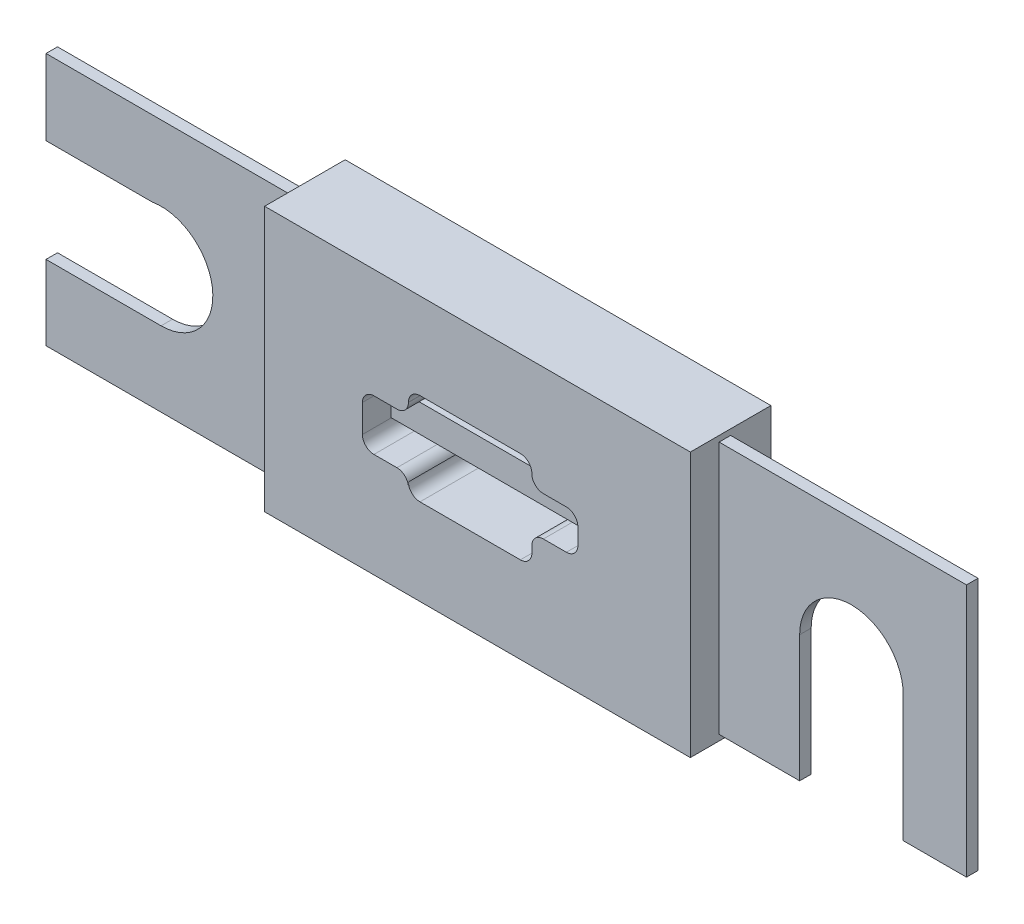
from build123d import *

# Parameters (mm, degrees)
BASE_EXTRUSION_DEPTH = 1
ESQUISSE2_W          = 37
ESQUISSE2_H          = 23
BOSS_EXTRU_1_DEPTH   = 3.5


with BuildPart() as part:
    # Esquisse1 → Base-Extrusion (new body)
    with BuildSketch(Plane.XY):
        with BuildLine():
            Line((-10, 4.433831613), (-0.768854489, 4.433831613))
            ThreePointArc((-0.768854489, 4.433831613), (4.483427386, 0.385848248), (0, -4.5))
            Line((0, -4.5), (-10, -4.5))
            Line((-10, -4.5), (-10, -11))
            Line((-10, -11), (12, -11))
            ThreePointArc((12, -11), (14.121320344, -10.121320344), (15, -8))
            Line((15, -8), (15, -4.417353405))
            ThreePointArc((15, -4.417353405), (15.878679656, -2.296033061), (18, -1.417353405))
            Line((18, -1.417353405), (42, -1.417353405))
            ThreePointArc((42, -1.417353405), (44.121320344, -2.296033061), (45, -4.417353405))
            Line((45, -4.417353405), (45, -8))
            ThreePointArc((45, -8), (45.878679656, -10.121320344), (48, -11))
            Line((48, -11), (55.5, -11))
            Line((55.5, -11), (55.5, 0))
            ThreePointArc((55.5, 0), (60, 4.5), (64.5, 0))
            Line((64.5, 0), (64.5, -11))
            Line((64.5, -11), (70, -11))
            Line((70, -11), (70, 11))
            Line((70, 11), (48, 11))
            ThreePointArc((48, 11), (45.878679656, 10.121320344), (45, 8))
            Line((45, 8), (45, 4))
            ThreePointArc((45, 4), (44.121320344, 1.878679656), (42, 1))
            Line((42, 1), (18, 1))
            ThreePointArc((18, 1), (15.878679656, 1.878679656), (15, 4))
            Line((15, 4), (15, 8))
            ThreePointArc((15, 8), (14.121320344, 10.121320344), (12, 11))
            Line((12, 11), (-10, 11))
            Line((-10, 11), (-10, 4.433831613))
        make_face()
    extrude(amount=BASE_EXTRUSION_DEPTH)

    # Esquisse2 → Boss.-Extru.1 (add, symmetric)
    with BuildSketch(Plane.XY):
        with Locations((30, 0)):
            Rectangle(ESQUISSE2_W, ESQUISSE2_H)
        with BuildLine():
            Line((21, 1.981396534), (23, 1.981396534))
            ThreePointArc((23, 1.981396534), (23.707106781, 2.274289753), (24, 2.981396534))
            Line((24, 2.981396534), (24, 3))
            ThreePointArc((24, 3), (24.292893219, 3.707106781), (25, 4))
            Line((25, 4), (33.726160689, 4))
            ThreePointArc((33.726160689, 4), (34.433267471, 3.707106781), (34.726160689, 3))
            Line((34.726160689, 3), (34.726160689, 2.981396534))
            ThreePointArc((34.726160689, 2.981396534), (35.019053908, 2.274289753), (35.726160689, 1.981396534))
            Line((35.726160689, 1.981396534), (37.726160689, 1.981396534))
            ThreePointArc((37.726160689, 1.981396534), (38.433267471, 1.688503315), (38.726160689, 0.981396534))
            Line((38.726160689, 0.981396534), (38.726160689, -0.429686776))
            ThreePointArc((38.726160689, -0.429686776), (38.433267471, -1.136793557), (37.726160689, -1.429686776))
            Line((37.726160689, -1.429686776), (35.726160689, -1.429686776))
            ThreePointArc((35.726160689, -1.429686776), (35.019053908, -1.722579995), (34.726160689, -2.429686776))
            Line((34.726160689, -2.429686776), (34.726160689, -3))
            ThreePointArc((34.726160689, -3), (34.433267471, -3.707106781), (33.726160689, -4))
            Line((33.726160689, -4), (25, -4))
            ThreePointArc((25, -4), (24.292893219, -3.707106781), (24, -3))
            Line((24, -3), (24, -3.429686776))
            ThreePointArc((24, -3.429686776), (23.707106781, -2.722579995), (23, -2.429686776))
            Line((23, -2.429686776), (21, -2.429686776))
            ThreePointArc((21, -2.429686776), (20.292893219, -2.136793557), (20, -1.429686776))
            Line((20, -1.429686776), (20, 0.981396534))
            ThreePointArc((20, 0.981396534), (20.292893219, 1.688503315), (21, 1.981396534))
        make_face(mode=Mode.SUBTRACT)
    extrude(amount=BOSS_EXTRU_1_DEPTH, both=True)


solid = part.part
